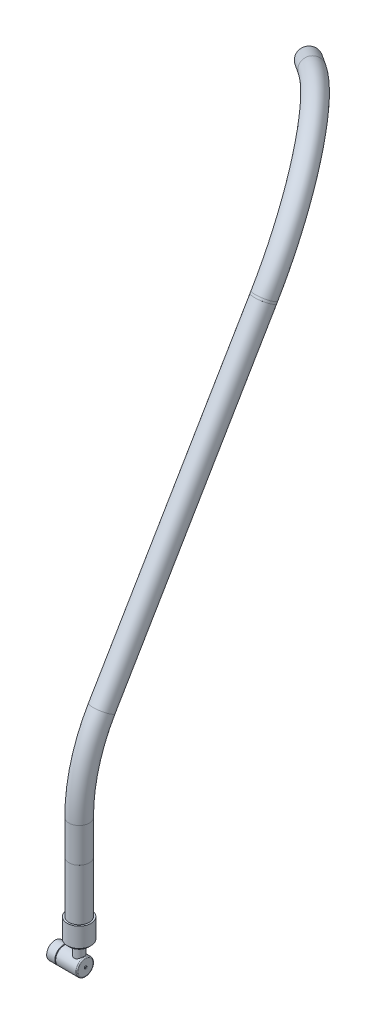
ISO-10303-21;
HEADER;
FILE_DESCRIPTION(('STEP AP214'),'2;1');
FILE_NAME('part.step','',(''),(''),'','','');
FILE_SCHEMA(('AUTOMOTIVE_DESIGN { 1 0 10303 214 1 1 1 1 }'));
ENDSEC;
DATA;
#1=APPLICATION_CONTEXT('core data for automotive mechanical design processes');
#2=APPLICATION_PROTOCOL_DEFINITION('international standard','automotive_design',2000,#1);
#3=PRODUCT_CONTEXT('',#1,'mechanical');
#4=PRODUCT('Part','Part','',(#3));
#5=PRODUCT_RELATED_PRODUCT_CATEGORY('part','',(#4));
#6=PRODUCT_DEFINITION_FORMATION('','',#4);
#7=PRODUCT_DEFINITION_CONTEXT('part definition',#1,'design');
#8=PRODUCT_DEFINITION('design','',#6,#7);
#9=PRODUCT_DEFINITION_SHAPE('','',#8);
#10=(LENGTH_UNIT() NAMED_UNIT(*) SI_UNIT(.MILLI.,.METRE.));
#11=(NAMED_UNIT(*) PLANE_ANGLE_UNIT() SI_UNIT($,.RADIAN.));
#12=(NAMED_UNIT(*) SI_UNIT($,.STERADIAN.) SOLID_ANGLE_UNIT());
#13=UNCERTAINTY_MEASURE_WITH_UNIT(LENGTH_MEASURE(1.E-05),#10,'distance_accuracy_value','');
#14=(GEOMETRIC_REPRESENTATION_CONTEXT(3) GLOBAL_UNCERTAINTY_ASSIGNED_CONTEXT((#13)) GLOBAL_UNIT_ASSIGNED_CONTEXT((#10,
#11,#12)) REPRESENTATION_CONTEXT('',''));
#15=CARTESIAN_POINT('',(0.,0.,0.));
#16=DIRECTION('',(0.,0.,1.));
#17=DIRECTION('',(1.,0.,0.));
#18=AXIS2_PLACEMENT_3D('',#15,#16,#17);
#19=CARTESIAN_POINT('',(-231.402057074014,1296.7226905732,-781.534195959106));
#20=DIRECTION('',(-0.669130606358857,0.377342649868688,0.640216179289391));
#21=DIRECTION('',(0.691323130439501,0.,0.722545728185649));
#22=AXIS2_PLACEMENT_3D('',#19,#20,#21);
#23=TOROIDAL_SURFACE('',#22,406.4,29.9720000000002);
#24=CARTESIAN_POINT('',(70.612,1434.80149921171,-547.26360041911));
#25=DIRECTION('',(0.,0.861495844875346,-0.507764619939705));
#26=DIRECTION('',(0.,0.507764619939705,0.861495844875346));
#27=AXIS2_PLACEMENT_3D('',#24,#25,#26);
#28=CIRCLE('',#27,29.9720000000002);
#29=CARTESIAN_POINT('',(92.8855367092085,1444.9848113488,-529.986143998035));
#30=VERTEX_POINT('',#29);
#31=EDGE_CURVE('E394',#30,#30,#28,.T.);
#32=CARTESIAN_POINT('',(-221.411113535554,1651.21076854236,-980.026874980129));
#33=DIRECTION('',(-0.74273808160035,-0.311075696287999,-0.592935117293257));
#34=DIRECTION('',(-0.48081103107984,0.864078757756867,0.148958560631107));
#35=AXIS2_PLACEMENT_3D('',#32,#33,#34);
#36=CIRCLE('',#35,29.9720000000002);
#37=CARTESIAN_POINT('',(-220.674281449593,1677.35426429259,-994.665710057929));
#38=VERTEX_POINT('',#37);
#39=EDGE_CURVE('E11',#38,#38,#36,.T.);
#40=CARTESIAN_POINT('',(-231.402057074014,1296.7226905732,-781.534195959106));
#41=DIRECTION('',(-0.669130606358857,0.377342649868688,0.640216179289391));
#42=DIRECTION('',(0.691323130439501,0.,0.722545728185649));
#43=AXIS2_PLACEMENT_3D('',#40,#41,#42);
#44=CIRCLE('',#43,436.372);
#45=EDGE_CURVE('',#30,#38,#44,.T.);
#46=ORIENTED_EDGE('',*,*,#31,.T.);
#47=ORIENTED_EDGE('',*,*,#39,.F.);
#48=ORIENTED_EDGE('',*,*,#45,.T.);
#49=ORIENTED_EDGE('',*,*,#45,.F.);
#50=EDGE_LOOP('',(#46,#48,#47,#49));
#51=FACE_BOUND('',#50,.T.);
#52=ADVANCED_FACE('F388',(#51),#23,.T.);
#53=CARTESIAN_POINT('',(70.612,1434.80149921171,-547.26360041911));
#54=DIRECTION('',(0.,-0.861495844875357,0.507764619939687));
#55=DIRECTION('',(0.,-0.507764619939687,-0.861495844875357));
#56=AXIS2_PLACEMENT_3D('',#53,#54,#55);
#57=CYLINDRICAL_SURFACE('',#56,29.9720000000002);
#58=ORIENTED_EDGE('',*,*,#31,.F.);
#59=EDGE_LOOP('',(#58));
#60=FACE_BOUND('',#59,.T.);
#61=CARTESIAN_POINT('',(70.6119999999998,1429.33100059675,-544.039295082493));
#62=DIRECTION('',(0.,0.861495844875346,-0.507764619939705));
#63=DIRECTION('',(0.,0.507764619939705,0.861495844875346));
#64=AXIS2_PLACEMENT_3D('',#61,#62,#63);
#65=CIRCLE('',#64,29.9720000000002);
#66=CARTESIAN_POINT('',(70.6119999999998,1444.54972178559,-518.218541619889));
#67=VERTEX_POINT('',#66);
#68=EDGE_CURVE('E398',#67,#67,#65,.T.);
#69=ORIENTED_EDGE('',*,*,#68,.T.);
#70=EDGE_LOOP('',(#69));
#71=FACE_BOUND('',#70,.T.);
#72=ADVANCED_FACE('F419',(#60,#71),#57,.T.);
#73=CARTESIAN_POINT('',(70.6119999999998,1429.33100059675,-544.039295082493));
#74=DIRECTION('',(0.,0.861495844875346,-0.507764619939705));
#75=DIRECTION('',(0.,0.507764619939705,0.861495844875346));
#76=AXIS2_PLACEMENT_3D('',#73,#74,#75);
#77=PLANE('',#76);
#78=ORIENTED_EDGE('',*,*,#68,.F.);
#79=EDGE_LOOP('',(#78));
#80=FACE_BOUND('',#79,.T.);
#81=ADVANCED_FACE('F412',(#80),#77,.F.);
#82=CARTESIAN_POINT('',(-273.291368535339,1629.48213115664,-1021.44339292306));
#83=DIRECTION('',(0.74273808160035,0.311075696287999,0.592935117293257));
#84=DIRECTION('',(0.623889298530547,0.,-0.781512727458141));
#85=AXIS2_PLACEMENT_3D('',#82,#83,#84);
#86=CYLINDRICAL_SURFACE('',#85,29.9720000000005);
#87=CARTESIAN_POINT('',(-273.291368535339,1629.48213115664,-1021.44339292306));
#88=DIRECTION('',(-0.74273808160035,-0.311075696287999,-0.592935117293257));
#89=DIRECTION('',(-0.623889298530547,0.,0.781512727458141));
#90=AXIS2_PLACEMENT_3D('',#87,#88,#89);
#91=CIRCLE('',#90,29.9720000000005);
#92=CARTESIAN_POINT('',(-291.990578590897,1629.48213115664,-998.019893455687));
#93=VERTEX_POINT('',#92);
#94=EDGE_CURVE('E402',#93,#93,#91,.T.);
#95=ORIENTED_EDGE('',*,*,#94,.F.);
#96=EDGE_LOOP('',(#95));
#97=FACE_BOUND('',#96,.T.);
#98=ORIENTED_EDGE('',*,*,#39,.T.);
#99=EDGE_LOOP('',(#98));
#100=FACE_BOUND('',#99,.T.);
#101=ADVANCED_FACE('F410',(#97,#100),#86,.T.);
#102=CARTESIAN_POINT('',(-273.291368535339,1629.48213115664,-1021.44339292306));
#103=DIRECTION('',(-0.74273808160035,-0.311075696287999,-0.592935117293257));
#104=DIRECTION('',(-0.623889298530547,0.,0.781512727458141));
#105=AXIS2_PLACEMENT_3D('',#102,#103,#104);
#106=PLANE('',#105);
#107=ORIENTED_EDGE('',*,*,#94,.T.);
#108=EDGE_LOOP('',(#107));
#109=FACE_BOUND('',#108,.T.);
#110=ADVANCED_FACE('F408',(#109),#106,.T.);
#111=CLOSED_SHELL('',(#52,#72,#81,#101,#110));
#112=MANIFOLD_SOLID_BREP('B2',#111);
#113=CARTESIAN_POINT('',(70.6119999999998,1429.33100059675,-544.039295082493));
#114=DIRECTION('',(0.,-0.861495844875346,0.507764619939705));
#115=DIRECTION('',(0.,-0.507764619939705,-0.861495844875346));
#116=AXIS2_PLACEMENT_3D('',#113,#114,#115);
#117=CYLINDRICAL_SURFACE('',#116,29.972);
#118=CARTESIAN_POINT('',(70.6119999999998,1429.33100059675,-544.039295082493));
#119=DIRECTION('',(0.,0.861495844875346,-0.507764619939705));
#120=DIRECTION('',(0.,0.507764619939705,0.861495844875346));
#121=AXIS2_PLACEMENT_3D('',#118,#119,#120);
#122=CIRCLE('',#121,29.972);
#123=CARTESIAN_POINT('',(70.6119999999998,1444.54972178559,-518.218541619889));
#124=VERTEX_POINT('',#123);
#125=EDGE_CURVE('E387',#124,#124,#122,.T.);
#126=ORIENTED_EDGE('',*,*,#125,.F.);
#127=EDGE_LOOP('',(#126));
#128=FACE_BOUND('',#127,.T.);
#129=CARTESIAN_POINT('',(70.6119999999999,619.697205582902,-66.842105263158));
#130=DIRECTION('',(0.,0.861495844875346,-0.507764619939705));
#131=DIRECTION('',(0.,0.507764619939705,0.861495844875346));
#132=AXIS2_PLACEMENT_3D('',#129,#130,#131);
#133=CIRCLE('',#132,29.972);
#134=CARTESIAN_POINT('',(70.6119999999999,634.915926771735,-41.0213518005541));
#135=VERTEX_POINT('',#134);
#136=EDGE_CURVE('E462',#135,#135,#133,.T.);
#137=ORIENTED_EDGE('',*,*,#136,.T.);
#138=EDGE_LOOP('',(#137));
#139=FACE_BOUND('',#138,.T.);
#140=ADVANCED_FACE('F456',(#128,#139),#117,.T.);
#141=CARTESIAN_POINT('',(70.6119999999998,1429.33100059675,-544.039295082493));
#142=DIRECTION('',(0.,0.861495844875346,-0.507764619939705));
#143=DIRECTION('',(0.,0.507764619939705,0.861495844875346));
#144=AXIS2_PLACEMENT_3D('',#141,#142,#143);
#145=PLANE('',#144);
#146=ORIENTED_EDGE('',*,*,#125,.T.);
#147=EDGE_LOOP('',(#146));
#148=FACE_BOUND('',#147,.T.);
#149=ADVANCED_FACE('F471',(#148),#145,.T.);
#150=CARTESIAN_POINT('',(70.6119999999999,619.697205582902,-66.842105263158));
#151=DIRECTION('',(0.,0.861495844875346,-0.507764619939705));
#152=DIRECTION('',(0.,0.507764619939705,0.861495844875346));
#153=AXIS2_PLACEMENT_3D('',#150,#151,#152);
#154=PLANE('',#153);
#155=ORIENTED_EDGE('',*,*,#136,.F.);
#156=EDGE_LOOP('',(#155));
#157=FACE_BOUND('',#156,.T.);
#158=ADVANCED_FACE('F469',(#157),#154,.F.);
#159=CLOSED_SHELL('',(#140,#149,#158));
#160=MANIFOLD_SOLID_BREP('B6',#159);
#161=CARTESIAN_POINT('',(70.6119999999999,374.65,-482.6));
#162=DIRECTION('',(-1.,0.,0.));
#163=DIRECTION('',(0.,0.,1.));
#164=AXIS2_PLACEMENT_3D('',#161,#162,#163);
#165=TOROIDAL_SURFACE('',#164,482.6,29.972);
#166=CARTESIAN_POINT('',(70.6119999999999,374.65,0.));
#167=DIRECTION('',(0.,1.,0.));
#168=DIRECTION('',(-1.,0.,0.));
#169=AXIS2_PLACEMENT_3D('',#166,#167,#168);
#170=CIRCLE('',#169,29.972);
#171=CARTESIAN_POINT('',(70.6119999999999,374.65,29.9719999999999));
#172=VERTEX_POINT('',#171);
#173=EDGE_CURVE('E504',#172,#172,#170,.T.);
#174=CARTESIAN_POINT('',(70.6119999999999,619.697205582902,-66.8421052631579));
#175=DIRECTION('',(0.,0.861495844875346,-0.507764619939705));
#176=DIRECTION('',(-1.,0.,0.));
#177=AXIS2_PLACEMENT_3D('',#174,#175,#176);
#178=CIRCLE('',#177,29.972);
#179=CARTESIAN_POINT('',(70.6119999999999,634.915926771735,-41.021351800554));
#180=VERTEX_POINT('',#179);
#181=EDGE_CURVE('E455',#180,#180,#178,.T.);
#182=CARTESIAN_POINT('',(70.6119999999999,374.65,-482.6));
#183=DIRECTION('',(-1.,0.,0.));
#184=DIRECTION('',(0.,0.,1.));
#185=AXIS2_PLACEMENT_3D('',#182,#183,#184);
#186=CIRCLE('',#185,512.572);
#187=EDGE_CURVE('',#172,#180,#186,.T.);
#188=ORIENTED_EDGE('',*,*,#173,.T.);
#189=ORIENTED_EDGE('',*,*,#181,.F.);
#190=ORIENTED_EDGE('',*,*,#187,.T.);
#191=ORIENTED_EDGE('',*,*,#187,.F.);
#192=EDGE_LOOP('',(#188,#190,#189,#191));
#193=FACE_BOUND('',#192,.T.);
#194=ADVANCED_FACE('F498',(#193),#165,.T.);
#195=CARTESIAN_POINT('',(70.6119999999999,374.65,0.));
#196=DIRECTION('',(0.,-1.,0.));
#197=DIRECTION('',(0.,0.,-1.));
#198=AXIS2_PLACEMENT_3D('',#195,#196,#197);
#199=CYLINDRICAL_SURFACE('',#198,29.972);
#200=ORIENTED_EDGE('',*,*,#173,.F.);
#201=EDGE_LOOP('',(#200));
#202=FACE_BOUND('',#201,.T.);
#203=CARTESIAN_POINT('',(70.6119999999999,273.05,0.));
#204=DIRECTION('',(0.,1.,0.));
#205=DIRECTION('',(-1.,0.,0.));
#206=AXIS2_PLACEMENT_3D('',#203,#204,#205);
#207=CIRCLE('',#206,29.972);
#208=CARTESIAN_POINT('',(40.6399999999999,273.05,0.));
#209=VERTEX_POINT('',#208);
#210=EDGE_CURVE('E508',#209,#209,#207,.T.);
#211=ORIENTED_EDGE('',*,*,#210,.T.);
#212=EDGE_LOOP('',(#211));
#213=FACE_BOUND('',#212,.T.);
#214=ADVANCED_FACE('F515',(#202,#213),#199,.T.);
#215=CARTESIAN_POINT('',(70.6119999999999,619.697205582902,-66.8421052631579));
#216=DIRECTION('',(0.,0.861495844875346,-0.507764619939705));
#217=DIRECTION('',(-1.,0.,0.));
#218=AXIS2_PLACEMENT_3D('',#215,#216,#217);
#219=PLANE('',#218);
#220=ORIENTED_EDGE('',*,*,#181,.T.);
#221=EDGE_LOOP('',(#220));
#222=FACE_BOUND('',#221,.T.);
#223=ADVANCED_FACE('F519',(#222),#219,.T.);
#224=CARTESIAN_POINT('',(70.6119999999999,273.05,0.));
#225=DIRECTION('',(0.,1.,0.));
#226=DIRECTION('',(-1.,0.,0.));
#227=AXIS2_PLACEMENT_3D('',#224,#225,#226);
#228=PLANE('',#227);
#229=ORIENTED_EDGE('',*,*,#210,.F.);
#230=EDGE_LOOP('',(#229));
#231=FACE_BOUND('',#230,.T.);
#232=ADVANCED_FACE('F517',(#231),#228,.F.);
#233=CLOSED_SHELL('',(#194,#214,#223,#232));
#234=MANIFOLD_SOLID_BREP('B382',#233);
#235=CARTESIAN_POINT('',(70.6119999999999,273.05,0.));
#236=DIRECTION('',(0.,-1.,0.));
#237=DIRECTION('',(1.,0.,0.));
#238=AXIS2_PLACEMENT_3D('',#235,#236,#237);
#239=CYLINDRICAL_SURFACE('',#238,29.972);
#240=CARTESIAN_POINT('',(70.6119999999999,273.05,0.));
#241=DIRECTION('',(0.,1.,0.));
#242=DIRECTION('',(-1.,0.,0.));
#243=AXIS2_PLACEMENT_3D('',#240,#241,#242);
#244=CIRCLE('',#243,29.972);
#245=CARTESIAN_POINT('',(100.584,273.05,0.));
#246=VERTEX_POINT('',#245);
#247=EDGE_CURVE('E497',#246,#246,#244,.T.);
#248=CARTESIAN_POINT('',(70.612,120.65,0.));
#249=DIRECTION('',(0.,1.,0.));
#250=DIRECTION('',(-1.,0.,0.));
#251=AXIS2_PLACEMENT_3D('',#248,#249,#250);
#252=CIRCLE('',#251,29.972);
#253=CARTESIAN_POINT('',(100.584,120.65,0.));
#254=VERTEX_POINT('',#253);
#255=EDGE_CURVE('E559',#254,#254,#252,.T.);
#256=CARTESIAN_POINT('',(100.584,273.05,0.));
#257=CARTESIAN_POINT('',(100.584,271.4625,0.));
#258=CARTESIAN_POINT('',(100.584,269.875,0.));
#259=CARTESIAN_POINT('',(100.584,266.7,0.));
#260=CARTESIAN_POINT('',(100.584,265.1125,0.));
#261=CARTESIAN_POINT('',(100.584,261.9375,0.));
#262=CARTESIAN_POINT('',(100.584,260.35,0.));
#263=CARTESIAN_POINT('',(100.584,257.175,0.));
#264=CARTESIAN_POINT('',(100.584,255.5875,0.));
#265=CARTESIAN_POINT('',(100.584,252.4125,0.));
#266=CARTESIAN_POINT('',(100.584,250.825,0.));
#267=CARTESIAN_POINT('',(100.584,247.65,0.));
#268=CARTESIAN_POINT('',(100.584,246.0625,0.));
#269=CARTESIAN_POINT('',(100.584,242.8875,0.));
#270=CARTESIAN_POINT('',(100.584,241.3,0.));
#271=CARTESIAN_POINT('',(100.584,238.125,0.));
#272=CARTESIAN_POINT('',(100.584,236.5375,0.));
#273=CARTESIAN_POINT('',(100.584,233.3625,0.));
#274=CARTESIAN_POINT('',(100.584,231.775,0.));
#275=CARTESIAN_POINT('',(100.584,228.6,0.));
#276=CARTESIAN_POINT('',(100.584,227.0125,0.));
#277=CARTESIAN_POINT('',(100.584,223.8375,0.));
#278=CARTESIAN_POINT('',(100.584,222.25,0.));
#279=CARTESIAN_POINT('',(100.584,219.075,0.));
#280=CARTESIAN_POINT('',(100.584,217.4875,0.));
#281=CARTESIAN_POINT('',(100.584,214.3125,0.));
#282=CARTESIAN_POINT('',(100.584,212.725,0.));
#283=CARTESIAN_POINT('',(100.584,209.55,0.));
#284=CARTESIAN_POINT('',(100.584,207.9625,0.));
#285=CARTESIAN_POINT('',(100.584,204.7875,0.));
#286=CARTESIAN_POINT('',(100.584,203.2,0.));
#287=CARTESIAN_POINT('',(100.584,200.025,0.));
#288=CARTESIAN_POINT('',(100.584,198.4375,0.));
#289=CARTESIAN_POINT('',(100.584,195.2625,0.));
#290=CARTESIAN_POINT('',(100.584,193.675,0.));
#291=CARTESIAN_POINT('',(100.584,190.5,0.));
#292=CARTESIAN_POINT('',(100.584,188.9125,0.));
#293=CARTESIAN_POINT('',(100.584,185.7375,0.));
#294=CARTESIAN_POINT('',(100.584,184.15,0.));
#295=CARTESIAN_POINT('',(100.584,180.975,0.));
#296=CARTESIAN_POINT('',(100.584,179.3875,0.));
#297=CARTESIAN_POINT('',(100.584,176.2125,0.));
#298=CARTESIAN_POINT('',(100.584,174.625,0.));
#299=CARTESIAN_POINT('',(100.584,171.45,0.));
#300=CARTESIAN_POINT('',(100.584,169.8625,0.));
#301=CARTESIAN_POINT('',(100.584,166.6875,0.));
#302=CARTESIAN_POINT('',(100.584,165.1,0.));
#303=CARTESIAN_POINT('',(100.584,161.925,0.));
#304=CARTESIAN_POINT('',(100.584,160.3375,0.));
#305=CARTESIAN_POINT('',(100.584,157.1625,0.));
#306=CARTESIAN_POINT('',(100.584,155.575,0.));
#307=CARTESIAN_POINT('',(100.584,152.4,0.));
#308=CARTESIAN_POINT('',(100.584,150.8125,0.));
#309=CARTESIAN_POINT('',(100.584,147.6375,0.));
#310=CARTESIAN_POINT('',(100.584,146.05,0.));
#311=CARTESIAN_POINT('',(100.584,142.875,0.));
#312=CARTESIAN_POINT('',(100.584,141.2875,0.));
#313=CARTESIAN_POINT('',(100.584,138.1125,0.));
#314=CARTESIAN_POINT('',(100.584,136.525,0.));
#315=CARTESIAN_POINT('',(100.584,133.35,0.));
#316=CARTESIAN_POINT('',(100.584,131.7625,0.));
#317=CARTESIAN_POINT('',(100.584,128.5875,0.));
#318=CARTESIAN_POINT('',(100.584,127.,0.));
#319=CARTESIAN_POINT('',(100.584,123.825,0.));
#320=CARTESIAN_POINT('',(100.584,122.2375,0.));
#321=CARTESIAN_POINT('',(100.584,120.65,0.));
#322=B_SPLINE_CURVE_WITH_KNOTS('',3,(#256,#257,#258,#259,#260,#261,#262,#263,#264,#265,#266,
#267,#268,#269,#270,#271,#272,#273,#274,#275,#276,#277,#278,#279,#280,#281,#282,#283,#284,#285,
#286,#287,#288,#289,#290,#291,#292,#293,#294,#295,#296,#297,#298,#299,#300,#301,#302,#303,#304,
#305,#306,#307,#308,#309,#310,#311,#312,#313,#314,#315,#316,#317,#318,#319,#320,#321),
.UNSPECIFIED.,.F.,.F.,(4,2,2,2,2,2,2,2,2,2,2,2,2,2,2,2,2,2,2,2,2,2,2,2,2,2,2,2,2,2,2,2,4),(0.,
4.76249999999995,9.52499999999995,14.2875,19.05,23.8125,28.575,33.3375,38.1,42.8625,47.625,
52.3875,57.15,61.9125,66.675,71.4375,76.2,80.9625,85.725,90.4875,95.25,100.0125,104.775,
109.5375,114.3,119.0625,123.825,128.5875,133.35,138.1125,142.875,147.6375,152.4),.UNSPECIFIED.);
#323=EDGE_CURVE('BSEAM553',#246,#254,#322,.T.);
#324=ORIENTED_EDGE('',*,*,#247,.F.);
#325=ORIENTED_EDGE('',*,*,#255,.T.);
#326=ORIENTED_EDGE('',*,*,#323,.T.);
#327=ORIENTED_EDGE('',*,*,#323,.F.);
#328=EDGE_LOOP('',(#324,#326,#325,#327));
#329=FACE_BOUND('',#328,.T.);
#330=ADVANCED_FACE('F553',(#329),#239,.T.);
#331=CARTESIAN_POINT('',(70.6119999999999,273.05,0.));
#332=DIRECTION('',(0.,1.,0.));
#333=DIRECTION('',(-1.,0.,0.));
#334=AXIS2_PLACEMENT_3D('',#331,#332,#333);
#335=PLANE('',#334);
#336=ORIENTED_EDGE('',*,*,#247,.T.);
#337=EDGE_LOOP('',(#336));
#338=FACE_BOUND('',#337,.T.);
#339=ADVANCED_FACE('F568',(#338),#335,.T.);
#340=CARTESIAN_POINT('',(70.612,120.65,0.));
#341=DIRECTION('',(0.,1.,0.));
#342=DIRECTION('',(-1.,0.,0.));
#343=AXIS2_PLACEMENT_3D('',#340,#341,#342);
#344=PLANE('',#343);
#345=ORIENTED_EDGE('',*,*,#255,.F.);
#346=EDGE_LOOP('',(#345));
#347=FACE_BOUND('',#346,.T.);
#348=ADVANCED_FACE('F566',(#347),#344,.F.);
#349=CLOSED_SHELL('',(#330,#339,#348));
#350=MANIFOLD_SOLID_BREP('B450',#349);
#351=CARTESIAN_POINT('',(91.694,0.,0.));
#352=DIRECTION('',(-1.,0.,0.));
#353=DIRECTION('',(0.,0.,1.));
#354=AXIS2_PLACEMENT_3D('',#351,#352,#353);
#355=CYLINDRICAL_SURFACE('',#354,3.6195);
#356=CARTESIAN_POINT('',(90.17,0.,0.));
#357=DIRECTION('',(1.,0.,0.));
#358=DIRECTION('',(0.,0.,-1.));
#359=AXIS2_PLACEMENT_3D('',#356,#357,#358);
#360=CIRCLE('',#359,3.6195);
#361=CARTESIAN_POINT('',(90.17,0.,-3.6195));
#362=VERTEX_POINT('',#361);
#363=EDGE_CURVE('E552',#362,#362,#360,.F.);
#364=ORIENTED_EDGE('',*,*,#363,.T.);
#365=EDGE_LOOP('',(#364));
#366=FACE_BOUND('',#365,.T.);
#367=CARTESIAN_POINT('',(89.408,0.,0.));
#368=DIRECTION('',(1.,0.,0.));
#369=DIRECTION('',(0.,0.,-1.));
#370=AXIS2_PLACEMENT_3D('',#367,#368,#369);
#371=CIRCLE('',#370,3.6195);
#372=CARTESIAN_POINT('',(89.408,0.,-3.6195));
#373=VERTEX_POINT('',#372);
#374=EDGE_CURVE('E605',#373,#373,#371,.T.);
#375=ORIENTED_EDGE('',*,*,#374,.T.);
#376=EDGE_LOOP('',(#375));
#377=FACE_BOUND('',#376,.T.);
#378=ADVANCED_FACE('F595',(#366,#377),#355,.T.);
#379=CARTESIAN_POINT('',(91.694,0.,0.));
#380=DIRECTION('',(1.,0.,0.));
#381=DIRECTION('',(0.,0.,-1.));
#382=AXIS2_PLACEMENT_3D('',#379,#380,#381);
#383=PLANE('',#382);
#384=CARTESIAN_POINT('',(91.694,0.,0.));
#385=DIRECTION('',(1.,0.,0.));
#386=DIRECTION('',(0.,0.,-1.));
#387=AXIS2_PLACEMENT_3D('',#384,#385,#386);
#388=CIRCLE('',#387,2.0955);
#389=CARTESIAN_POINT('',(91.694,0.,-2.0955));
#390=VERTEX_POINT('',#389);
#391=EDGE_CURVE('E601',#390,#390,#388,.T.);
#392=ORIENTED_EDGE('',*,*,#391,.T.);
#393=EDGE_LOOP('',(#392));
#394=FACE_BOUND('',#393,.T.);
#395=ADVANCED_FACE('F616',(#394),#383,.T.);
#396=CARTESIAN_POINT('',(89.408,0.,0.));
#397=DIRECTION('',(1.,0.,0.));
#398=DIRECTION('',(0.,0.,-1.));
#399=AXIS2_PLACEMENT_3D('',#396,#397,#398);
#400=PLANE('',#399);
#401=ORIENTED_EDGE('',*,*,#374,.F.);
#402=EDGE_LOOP('',(#401));
#403=FACE_BOUND('',#402,.T.);
#404=ADVANCED_FACE('F613',(#403),#400,.F.);
#405=CARTESIAN_POINT('',(90.17,0.,0.));
#406=DIRECTION('',(1.,0.,0.));
#407=DIRECTION('',(0.,0.,-1.));
#408=AXIS2_PLACEMENT_3D('',#405,#406,#407);
#409=TOROIDAL_SURFACE('',#408,2.0955,1.524);
#410=ORIENTED_EDGE('',*,*,#363,.F.);
#411=EDGE_LOOP('',(#410));
#412=FACE_BOUND('',#411,.T.);
#413=ORIENTED_EDGE('',*,*,#391,.F.);
#414=EDGE_LOOP('',(#413));
#415=FACE_BOUND('',#414,.T.);
#416=ADVANCED_FACE('F615',(#412,#415),#409,.T.);
#417=CLOSED_SHELL('',(#378,#395,#404,#416));
#418=MANIFOLD_SOLID_BREP('B492',#417);
#419=CARTESIAN_POINT('',(89.408,0.,0.));
#420=DIRECTION('',(-1.,0.,0.));
#421=DIRECTION('',(0.,0.,1.));
#422=AXIS2_PLACEMENT_3D('',#419,#420,#421);
#423=CYLINDRICAL_SURFACE('',#422,25.4);
#424=CARTESIAN_POINT('',(86.233,0.,0.));
#425=DIRECTION('',(1.,0.,0.));
#426=DIRECTION('',(0.,0.,-1.));
#427=AXIS2_PLACEMENT_3D('',#424,#425,#426);
#428=CIRCLE('',#427,25.4);
#429=CARTESIAN_POINT('',(86.233,0.,-25.4));
#430=VERTEX_POINT('',#429);
#431=EDGE_CURVE('E662',#430,#430,#428,.F.);
#432=ORIENTED_EDGE('',*,*,#431,.T.);
#433=EDGE_LOOP('',(#432));
#434=FACE_BOUND('',#433,.T.);
#435=CARTESIAN_POINT('',(26.67,0.,0.));
#436=DIRECTION('',(1.,0.,0.));
#437=DIRECTION('',(0.,0.,-1.));
#438=AXIS2_PLACEMENT_3D('',#435,#436,#437);
#439=CIRCLE('',#438,25.4);
#440=CARTESIAN_POINT('',(26.67,0.,-25.4));
#441=VERTEX_POINT('',#440);
#442=EDGE_CURVE('E677',#441,#441,#439,.T.);
#443=ORIENTED_EDGE('',*,*,#442,.T.);
#444=EDGE_LOOP('',(#443));
#445=FACE_BOUND('',#444,.T.);
#446=CARTESIAN_POINT('',(56.388,25.4,0.));
#447=CARTESIAN_POINT('',(56.387998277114,25.4000015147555,0.36870087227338));
#448=CARTESIAN_POINT('',(56.4023506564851,25.3919554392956,0.737380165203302));
#449=CARTESIAN_POINT('',(56.4595581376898,25.3599855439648,1.47180213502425));
#450=CARTESIAN_POINT('',(56.5024110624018,25.3360629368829,1.83754503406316));
#451=CARTESIAN_POINT('',(56.6160575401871,25.2729500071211,2.56334225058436));
#452=CARTESIAN_POINT('',(56.6868535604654,25.23375833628,2.92339606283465));
#453=CARTESIAN_POINT('',(56.8555056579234,25.1410819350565,3.63522175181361));
#454=CARTESIAN_POINT('',(56.9533625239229,25.0875967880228,3.98699338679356));
#455=CARTESIAN_POINT('',(57.1745985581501,24.9678386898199,4.6786503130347));
#456=CARTESIAN_POINT('',(57.2978799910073,24.9016147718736,5.01857546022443));
#457=CARTESIAN_POINT('',(57.5689372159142,24.7577487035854,5.68598521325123));
#458=CARTESIAN_POINT('',(57.7167127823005,24.6801066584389,6.01346993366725));
#459=CARTESIAN_POINT('',(58.0354451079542,24.515076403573,6.65436190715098));
#460=CARTESIAN_POINT('',(58.20640115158,24.4276884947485,6.96776959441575));
#461=CARTESIAN_POINT('',(58.570260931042,24.2449283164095,7.57927040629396));
#462=CARTESIAN_POINT('',(58.7631727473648,24.1495531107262,7.87735783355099));
#463=CARTESIAN_POINT('',(59.1839017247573,23.9458354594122,8.47727627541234));
#464=CARTESIAN_POINT('',(59.4132173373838,23.8370526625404,8.77790704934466));
#465=CARTESIAN_POINT('',(59.8941000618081,23.6149470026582,9.3590091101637));
#466=CARTESIAN_POINT('',(60.1456680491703,23.5016239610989,9.63947960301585));
#467=CARTESIAN_POINT('',(60.6700740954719,23.272816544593,10.1794940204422));
#468=CARTESIAN_POINT('',(60.9429359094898,23.1573298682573,10.439013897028));
#469=CARTESIAN_POINT('',(61.5084182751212,22.9269790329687,10.9356550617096));
#470=CARTESIAN_POINT('',(61.8010331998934,22.8121147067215,11.172782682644));
#471=CARTESIAN_POINT('',(62.4363375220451,22.5739627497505,11.6470476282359));
#472=CARTESIAN_POINT('',(62.7810728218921,22.4510370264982,11.8816353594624));
#473=CARTESIAN_POINT('',(63.4918775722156,22.2131004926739,12.3207368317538));
#474=CARTESIAN_POINT('',(63.8579498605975,22.0980907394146,12.5252465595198));
#475=CARTESIAN_POINT('',(64.6091914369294,21.8801850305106,12.9021257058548));
#476=CARTESIAN_POINT('',(64.9943375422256,21.7772748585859,13.0745329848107));
#477=CARTESIAN_POINT('',(65.7818526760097,21.5875498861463,13.3854740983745));
#478=CARTESIAN_POINT('',(66.1842163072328,21.5007300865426,13.5240184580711));
#479=CARTESIAN_POINT('',(66.9158558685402,21.3634994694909,13.7394876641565));
#480=CARTESIAN_POINT('',(67.2424157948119,21.3092726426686,13.8232525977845));
#481=CARTESIAN_POINT('',(67.9026044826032,21.2149003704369,13.9676579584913));
#482=CARTESIAN_POINT('',(68.2362322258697,21.1747529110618,14.0283016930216));
#483=CARTESIAN_POINT('',(68.9081659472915,21.1099304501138,14.1256598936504));
#484=CARTESIAN_POINT('',(69.2464676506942,21.0852421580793,14.1623949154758));
#485=CARTESIAN_POINT('',(69.9256466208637,21.0521703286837,14.2115098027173));
#486=CARTESIAN_POINT('',(70.2665239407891,21.0437871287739,14.2238891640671));
#487=CARTESIAN_POINT('',(70.9486844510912,21.0436382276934,14.2241094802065));
#488=CARTESIAN_POINT('',(71.2899676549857,21.0518917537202,14.2119220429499));
#489=CARTESIAN_POINT('',(71.9699814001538,21.0847477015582,14.1631306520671));
#490=CARTESIAN_POINT('',(72.3087119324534,21.1093501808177,14.1265266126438));
#491=CARTESIAN_POINT('',(72.9814001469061,21.1740338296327,14.0293863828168));
#492=CARTESIAN_POINT('',(73.315355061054,21.2141236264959,13.9688368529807));
#493=CARTESIAN_POINT('',(73.976175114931,21.3084141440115,13.8245757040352));
#494=CARTESIAN_POINT('',(74.3030400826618,21.3626152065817,13.7408635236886));
#495=CARTESIAN_POINT('',(74.947503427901,21.4833495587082,13.5513204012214));
#496=CARTESIAN_POINT('',(75.2651121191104,21.5498684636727,13.4455152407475));
#497=CARTESIAN_POINT('',(75.8901060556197,21.693401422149,13.212684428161));
#498=CARTESIAN_POINT('',(76.1974878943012,21.7704189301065,13.0856517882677));
#499=CARTESIAN_POINT('',(76.80077912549,21.9329523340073,12.811362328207));
#500=CARTESIAN_POINT('',(77.0966874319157,22.0184690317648,12.6641035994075));
#501=CARTESIAN_POINT('',(77.6760541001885,22.1960047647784,12.3502983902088));
#502=CARTESIAN_POINT('',(77.95951177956,22.2880241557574,12.1837508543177));
#503=CARTESIAN_POINT('',(78.5559557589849,22.4911970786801,11.8050442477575));
#504=CARTESIAN_POINT('',(78.8667372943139,22.603110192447,11.5898137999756));
#505=CARTESIAN_POINT('',(79.4694036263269,22.8301008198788,11.1360159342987));
#506=CARTESIAN_POINT('',(79.7612920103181,22.9451777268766,10.8974529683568));
#507=CARTESIAN_POINT('',(80.3253868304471,23.1758798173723,10.3978059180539));
#508=CARTESIAN_POINT('',(80.597575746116,23.291505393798,10.1367022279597));
#509=CARTESIAN_POINT('',(81.1208067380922,23.5205764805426,9.59319869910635));
#510=CARTESIAN_POINT('',(81.3718479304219,23.6340218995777,9.31079797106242));
#511=CARTESIAN_POINT('',(81.8766785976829,23.8678787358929,8.69504849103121));
#512=CARTESIAN_POINT('',(82.1279905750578,23.9877714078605,8.35946338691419));
#513=CARTESIAN_POINT('',(82.6012863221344,24.2185491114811,7.6652257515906));
#514=CARTESIAN_POINT('',(82.8232676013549,24.3294333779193,7.30657126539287));
#515=CARTESIAN_POINT('',(83.2356789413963,24.5390213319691,6.56837501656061));
#516=CARTESIAN_POINT('',(83.4261242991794,24.6377309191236,6.18884350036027));
#517=CARTESIAN_POINT('',(83.77338462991,24.820113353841,5.41122718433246));
#518=CARTESIAN_POINT('',(83.9302037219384,24.903788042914,5.01314466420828));
#519=CARTESIAN_POINT('',(84.1983037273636,25.0482264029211,4.2300741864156));
#520=CARTESIAN_POINT('',(84.3120144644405,25.1101888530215,3.84613945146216));
#521=CARTESIAN_POINT('',(84.5070270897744,25.2171160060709,3.06778748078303));
#522=CARTESIAN_POINT('',(84.5883302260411,25.2620813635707,2.67337064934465));
#523=CARTESIAN_POINT('',(84.7172692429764,25.3336449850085,1.87772541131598));
#524=CARTESIAN_POINT('',(84.7649306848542,25.3602571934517,1.4765024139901));
#525=CARTESIAN_POINT('',(84.8259231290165,25.3943454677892,0.670660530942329));
#526=CARTESIAN_POINT('',(84.8392576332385,25.4018234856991,0.266041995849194));
#527=CARTESIAN_POINT('',(84.8318518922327,25.3976777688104,-0.495906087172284));
#528=CARTESIAN_POINT('',(84.8148753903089,25.3881638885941,-0.853290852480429));
#529=CARTESIAN_POINT('',(84.7541486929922,25.35424131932,-1.56503785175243));
#530=CARTESIAN_POINT('',(84.7104009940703,25.329834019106,-1.91940036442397));
#531=CARTESIAN_POINT('',(84.5966741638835,25.2667113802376,-2.62258088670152));
#532=CARTESIAN_POINT('',(84.5266949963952,25.2279960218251,-2.97139888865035));
#533=CARTESIAN_POINT('',(84.3613202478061,25.1371609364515,-3.66116958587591));
#534=CARTESIAN_POINT('',(84.265923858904,25.0850407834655,-4.00212203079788));
#535=CARTESIAN_POINT('',(84.0513340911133,24.9688893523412,-4.67221260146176));
#536=CARTESIAN_POINT('',(83.9322751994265,24.9049255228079,-5.00140562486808));
#537=CARTESIAN_POINT('',(83.6711690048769,24.7662569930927,-5.64817781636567));
#538=CARTESIAN_POINT('',(83.529122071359,24.6915524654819,-5.96575717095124));
#539=CARTESIAN_POINT('',(83.2232055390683,24.5329008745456,-6.58785559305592));
#540=CARTESIAN_POINT('',(83.0593332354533,24.4489526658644,-6.89237303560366));
#541=CARTESIAN_POINT('',(82.7109475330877,24.2734363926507,-7.48708468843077));
#542=CARTESIAN_POINT('',(82.5264317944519,24.1818674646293,-7.77727726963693));
#543=CARTESIAN_POINT('',(82.1177948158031,23.9830367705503,-8.37149811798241));
#544=CARTESIAN_POINT('',(81.8915510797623,23.8751314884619,-8.67385283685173));
#545=CARTESIAN_POINT('',(81.4167311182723,23.6545099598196,-9.2586088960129));
#546=CARTESIAN_POINT('',(81.1681535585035,23.5417934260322,-9.54100904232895));
#547=CARTESIAN_POINT('',(80.6496805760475,23.3139138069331,-10.0850628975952));
#548=CARTESIAN_POINT('',(80.3797629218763,23.198748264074,-10.3466943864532));
#549=CARTESIAN_POINT('',(79.8200223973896,22.9686831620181,-10.8478397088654));
#550=CARTESIAN_POINT('',(79.5301992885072,22.8537836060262,-11.0873532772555));
#551=CARTESIAN_POINT('',(78.9006285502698,22.6151661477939,-11.5669025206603));
#552=CARTESIAN_POINT('',(78.5588226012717,22.4917725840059,-11.8044061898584));
#553=CARTESIAN_POINT('',(77.8537579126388,22.2524368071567,-12.2496106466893));
#554=CARTESIAN_POINT('',(77.490496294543,22.1364955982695,-12.457307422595));
#555=CARTESIAN_POINT('',(76.7446931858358,21.9162267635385,-12.8408674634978));
#556=CARTESIAN_POINT('',(76.362174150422,21.8118860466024,-13.016766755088));
#557=CARTESIAN_POINT('',(75.5796738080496,21.6187892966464,-13.3350157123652));
#558=CARTESIAN_POINT('',(75.1796978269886,21.5300285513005,-13.4773755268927));
#559=CARTESIAN_POINT('',(74.4506880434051,21.3886341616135,-13.7003609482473));
#560=CARTESIAN_POINT('',(74.1243983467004,21.3323282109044,-13.7876727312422));
#561=CARTESIAN_POINT('',(73.4644277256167,21.2336477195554,-13.9391679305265));
#562=CARTESIAN_POINT('',(73.1307478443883,21.1912712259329,-14.0033545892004));
#563=CARTESIAN_POINT('',(72.4583677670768,21.1219126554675,-14.1077547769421));
#564=CARTESIAN_POINT('',(72.1196722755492,21.0949169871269,-14.1479894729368));
#565=CARTESIAN_POINT('',(71.4393439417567,21.0572311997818,-14.2040193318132));
#566=CARTESIAN_POINT('',(71.0977110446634,21.0465413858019,-14.2198140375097));
#567=CARTESIAN_POINT('',(70.4135857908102,21.0418636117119,-14.2267352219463));
#568=CARTESIAN_POINT('',(70.0710929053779,21.0478997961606,-14.2178260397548));
#569=CARTESIAN_POINT('',(69.3883384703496,21.0764992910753,-14.1753950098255));
#570=CARTESIAN_POINT('',(69.048076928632,21.0990626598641,-14.1418730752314));
#571=CARTESIAN_POINT('',(68.3720616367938,21.1599086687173,-14.0506674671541));
#572=CARTESIAN_POINT('',(68.0363104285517,21.198199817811,-13.9929707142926));
#573=CARTESIAN_POINT('',(67.3716887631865,21.2891766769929,-13.8541626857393));
#574=CARTESIAN_POINT('',(67.0428184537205,21.3418626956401,-13.7730509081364));
#575=CARTESIAN_POINT('',(66.3961305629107,21.4595194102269,-13.5889974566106));
#576=CARTESIAN_POINT('',(66.0782510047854,21.5244000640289,-13.4862151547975));
#577=CARTESIAN_POINT('',(65.4524886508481,21.6648415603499,-13.2594276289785));
#578=CARTESIAN_POINT('',(65.1446091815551,21.740405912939,-13.135415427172));
#579=CARTESIAN_POINT('',(64.5401214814,21.900240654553,-12.8671607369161));
#580=CARTESIAN_POINT('',(64.2435142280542,21.9845117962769,-12.7229164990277));
#581=CARTESIAN_POINT('',(63.6625615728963,22.1597788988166,-12.4151343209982));
#582=CARTESIAN_POINT('',(63.3782168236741,22.2507752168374,-12.2515953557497));
#583=CARTESIAN_POINT('',(62.7803505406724,22.451763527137,-11.8797932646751));
#584=CARTESIAN_POINT('',(62.4689666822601,22.5625400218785,-11.6685107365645));
#585=CARTESIAN_POINT('',(61.8647716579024,22.7875673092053,-11.2227051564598));
#586=CARTESIAN_POINT('',(61.5719570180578,22.9018174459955,-10.9881864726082));
#587=CARTESIAN_POINT('',(61.0056663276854,23.1311995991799,-10.496723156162));
#588=CARTESIAN_POINT('',(60.7322074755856,23.2463323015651,-10.239759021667));
#589=CARTESIAN_POINT('',(60.20606332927,23.4747775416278,-9.70461098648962));
#590=CARTESIAN_POINT('',(59.9533789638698,23.5880899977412,-9.42642613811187));
#591=CARTESIAN_POINT('',(59.4434814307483,23.822613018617,-8.81819999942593));
#592=CARTESIAN_POINT('',(59.1888192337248,23.9433240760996,-8.48581901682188));
#593=CARTESIAN_POINT('',(58.7085334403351,24.1761498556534,-7.79779939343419));
#594=CARTESIAN_POINT('',(58.4829123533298,24.2882638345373,-7.44215874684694));
#595=CARTESIAN_POINT('',(58.0629017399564,24.500711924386,-6.70972609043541));
#596=CARTESIAN_POINT('',(57.8684985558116,24.6010511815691,-6.33294342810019));
#597=CARTESIAN_POINT('',(57.5130054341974,24.7870637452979,-5.56050451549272));
#598=CARTESIAN_POINT('',(57.35191167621,24.8727387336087,-5.16485043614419));
#599=CARTESIAN_POINT('',(57.0744460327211,25.0217986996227,-4.38375358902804));
#600=CARTESIAN_POINT('',(56.9558550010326,25.0862671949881,-3.99930638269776));
#601=CARTESIAN_POINT('',(56.7512591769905,25.198226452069,-3.21939839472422));
#602=CARTESIAN_POINT('',(56.665253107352,25.2457178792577,-2.8239380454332));
#603=CARTESIAN_POINT('',(56.5271576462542,25.3222689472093,-2.02567105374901));
#604=CARTESIAN_POINT('',(56.4750431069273,25.3513422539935,-1.62287008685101));
#605=CARTESIAN_POINT('',(56.4054667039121,25.390206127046,-0.813370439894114));
#606=CARTESIAN_POINT('',(56.3880019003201,25.3999983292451,-0.406672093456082));
#607=CARTESIAN_POINT('',(56.388,25.4,0.));
#608=B_SPLINE_CURVE_WITH_KNOTS('',3,(#446,#447,#448,#449,#450,#451,#452,#453,#454,#455,#456,
#457,#458,#459,#460,#461,#462,#463,#464,#465,#466,#467,#468,#469,#470,#471,#472,#473,#474,#475,
#476,#477,#478,#479,#480,#481,#482,#483,#484,#485,#486,#487,#488,#489,#490,#491,#492,#493,#494,
#495,#496,#497,#498,#499,#500,#501,#502,#503,#504,#505,#506,#507,#508,#509,#510,#511,#512,#513,
#514,#515,#516,#517,#518,#519,#520,#521,#522,#523,#524,#525,#526,#527,#528,#529,#530,#531,#532,
#533,#534,#535,#536,#537,#538,#539,#540,#541,#542,#543,#544,#545,#546,#547,#548,#549,#550,#551,
#552,#553,#554,#555,#556,#557,#558,#559,#560,#561,#562,#563,#564,#565,#566,#567,#568,#569,#570,
#571,#572,#573,#574,#575,#576,#577,#578,#579,#580,#581,#582,#583,#584,#585,#586,#587,#588,#589,
#590,#591,#592,#593,#594,#595,#596,#597,#598,#599,#600,#601,#602,#603,#604,#605,#606,#607),
.UNSPECIFIED.,.T.,.F.,(4,2,2,2,2,2,2,2,2,2,2,2,2,2,2,2,2,2,2,2,2,2,2,2,2,2,2,2,2,2,2,2,2,2,2,2,
2,2,2,2,2,2,2,2,2,2,2,2,2,2,2,2,2,2,2,2,2,2,2,2,2,2,2,2,2,2,2,2,2,2,2,2,2,2,2,2,2,2,2,2,4),(0.,
1.10570123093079,2.21131800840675,3.31703242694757,4.42277908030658,5.52435178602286,
6.62591434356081,7.72744290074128,8.82937817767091,10.0084971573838,11.1876625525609,
12.3681627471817,13.5483280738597,14.850891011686,16.1536275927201,17.4548179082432,
18.7556032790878,19.7789401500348,20.8021305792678,21.8244401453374,22.8467708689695,
23.8702837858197,24.893800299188,25.9178877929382,26.9420001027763,27.9649239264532,
28.9881851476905,30.0115429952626,31.0349568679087,32.2165010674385,33.3978202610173,
34.5801775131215,35.7625841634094,37.0691041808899,38.3757350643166,39.681730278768,
40.9875654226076,42.2014053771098,43.4151985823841,44.628068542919,45.8408147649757,
46.9132541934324,47.9855936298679,49.0579345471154,50.1303095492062,51.1967555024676,
52.2631843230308,53.3297454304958,54.3964275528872,55.5734403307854,56.7505234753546,
57.9288494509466,59.1071895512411,60.4079748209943,61.7089350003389,63.0084118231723,
64.3074949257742,65.3337301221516,66.3598213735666,67.3850044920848,68.4102067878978,
69.436889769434,70.4635763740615,71.4908191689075,72.5180839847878,73.5380422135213,
74.5583363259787,75.5787187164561,76.5991553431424,77.7747525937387,78.9501292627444,
80.1265375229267,81.3029983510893,82.6086775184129,83.9144694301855,85.2196884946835,
86.5247577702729,87.7453893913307,88.9659731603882,90.185650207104,91.4052237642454),.UNSPECIFIED.);
#609=CARTESIAN_POINT('',(56.388,25.4,0.));
#610=VERTEX_POINT('',#609);
#611=EDGE_CURVE('E671',#610,#610,#608,.T.);
#612=ORIENTED_EDGE('',*,*,#611,.F.);
#613=EDGE_LOOP('',(#612));
#614=FACE_BOUND('',#613,.T.);
#615=ADVANCED_FACE('F650',(#434,#445,#614),#423,.T.);
#616=CARTESIAN_POINT('',(89.408,0.,0.));
#617=DIRECTION('',(1.,0.,0.));
#618=DIRECTION('',(0.,0.,-1.));
#619=AXIS2_PLACEMENT_3D('',#616,#617,#618);
#620=PLANE('',#619);
#621=CARTESIAN_POINT('',(89.408,0.,0.));
#622=DIRECTION('',(1.,0.,0.));
#623=DIRECTION('',(0.,0.,-1.));
#624=AXIS2_PLACEMENT_3D('',#621,#622,#623);
#625=CIRCLE('',#624,22.225);
#626=CARTESIAN_POINT('',(89.408,0.,-22.225));
#627=VERTEX_POINT('',#626);
#628=EDGE_CURVE('E666',#627,#627,#625,.T.);
#629=ORIENTED_EDGE('',*,*,#628,.T.);
#630=EDGE_LOOP('',(#629));
#631=FACE_BOUND('',#630,.T.);
#632=ADVANCED_FACE('F689',(#631),#620,.T.);
#633=CARTESIAN_POINT('',(26.67,0.,0.));
#634=DIRECTION('',(1.,0.,0.));
#635=DIRECTION('',(0.,0.,-1.));
#636=AXIS2_PLACEMENT_3D('',#633,#634,#635);
#637=PLANE('',#636);
#638=ORIENTED_EDGE('',*,*,#442,.F.);
#639=EDGE_LOOP('',(#638));
#640=FACE_BOUND('',#639,.T.);
#641=ADVANCED_FACE('F685',(#640),#637,.F.);
#642=CARTESIAN_POINT('',(70.612,194.691,0.));
#643=DIRECTION('',(0.,1.,0.));
#644=DIRECTION('',(-1.,0.,0.));
#645=AXIS2_PLACEMENT_3D('',#642,#643,#644);
#646=CYLINDRICAL_SURFACE('',#645,14.224);
#647=CARTESIAN_POINT('',(70.612,50.8,0.));
#648=DIRECTION('',(0.,1.,0.));
#649=DIRECTION('',(-1.,0.,0.));
#650=AXIS2_PLACEMENT_3D('',#647,#648,#649);
#651=CIRCLE('',#650,14.224);
#652=CARTESIAN_POINT('',(56.388,50.8,0.));
#653=VERTEX_POINT('',#652);
#654=EDGE_CURVE('E716',#653,#653,#651,.T.);
#655=ORIENTED_EDGE('',*,*,#654,.F.);
#656=EDGE_LOOP('',(#655));
#657=FACE_BOUND('',#656,.T.);
#658=ORIENTED_EDGE('',*,*,#611,.T.);
#659=EDGE_LOOP('',(#658));
#660=FACE_BOUND('',#659,.T.);
#661=ADVANCED_FACE('F679',(#657,#660),#646,.T.);
#662=CARTESIAN_POINT('',(86.233,0.,0.));
#663=DIRECTION('',(1.,0.,0.));
#664=DIRECTION('',(0.,0.,-1.));
#665=AXIS2_PLACEMENT_3D('',#662,#663,#664);
#666=TOROIDAL_SURFACE('',#665,22.225,3.175);
#667=ORIENTED_EDGE('',*,*,#431,.F.);
#668=EDGE_LOOP('',(#667));
#669=FACE_BOUND('',#668,.T.);
#670=ORIENTED_EDGE('',*,*,#628,.F.);
#671=EDGE_LOOP('',(#670));
#672=FACE_BOUND('',#671,.T.);
#673=ADVANCED_FACE('F684',(#669,#672),#666,.T.);
#674=CARTESIAN_POINT('',(70.612,50.8,0.));
#675=DIRECTION('',(0.,1.,0.));
#676=DIRECTION('',(-1.,0.,0.));
#677=AXIS2_PLACEMENT_3D('',#674,#675,#676);
#678=CONICAL_SURFACE('',#677,14.224,0.78539816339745);
#679=CARTESIAN_POINT('',(70.612,57.15,0.));
#680=DIRECTION('',(0.,1.,0.));
#681=DIRECTION('',(-1.,0.,0.));
#682=AXIS2_PLACEMENT_3D('',#679,#680,#681);
#683=CIRCLE('',#682,20.574);
#684=CARTESIAN_POINT('',(50.038,57.15,0.));
#685=VERTEX_POINT('',#684);
#686=EDGE_CURVE('E727',#685,#685,#683,.T.);
#687=ORIENTED_EDGE('',*,*,#686,.F.);
#688=EDGE_LOOP('',(#687));
#689=FACE_BOUND('',#688,.T.);
#690=ORIENTED_EDGE('',*,*,#654,.T.);
#691=EDGE_LOOP('',(#690));
#692=FACE_BOUND('',#691,.T.);
#693=ADVANCED_FACE('F700',(#689,#692),#678,.T.);
#694=CARTESIAN_POINT('',(70.612,57.15,0.));
#695=DIRECTION('',(0.,1.,0.));
#696=DIRECTION('',(-1.,0.,0.));
#697=AXIS2_PLACEMENT_3D('',#694,#695,#696);
#698=PLANE('',#697);
#699=CARTESIAN_POINT('',(70.612,57.15,0.));
#700=DIRECTION('',(0.,1.,0.));
#701=DIRECTION('',(-1.,0.,0.));
#702=AXIS2_PLACEMENT_3D('',#699,#700,#701);
#703=CIRCLE('',#702,28.575);
#704=CARTESIAN_POINT('',(42.037,57.15,0.));
#705=VERTEX_POINT('',#704);
#706=EDGE_CURVE('E594',#705,#705,#703,.F.);
#707=ORIENTED_EDGE('',*,*,#706,.T.);
#708=EDGE_LOOP('',(#707));
#709=FACE_BOUND('',#708,.T.);
#710=ORIENTED_EDGE('',*,*,#686,.T.);
#711=EDGE_LOOP('',(#710));
#712=FACE_BOUND('',#711,.T.);
#713=ADVANCED_FACE('F706',(#709,#712),#698,.F.);
#714=CARTESIAN_POINT('',(70.612,120.65,0.));
#715=DIRECTION('',(0.,-1.,0.));
#716=DIRECTION('',(1.,0.,0.));
#717=AXIS2_PLACEMENT_3D('',#714,#715,#716);
#718=CYLINDRICAL_SURFACE('',#717,34.925);
#719=CARTESIAN_POINT('',(70.612,63.5,0.));
#720=DIRECTION('',(0.,1.,0.));
#721=DIRECTION('',(0.,0.,1.));
#722=AXIS2_PLACEMENT_3D('',#719,#720,#721);
#723=CIRCLE('',#722,34.925);
#724=CARTESIAN_POINT('',(70.612,63.5,34.925));
#725=VERTEX_POINT('',#724);
#726=EDGE_CURVE('E658',#725,#725,#723,.T.);
#727=ORIENTED_EDGE('',*,*,#726,.T.);
#728=EDGE_LOOP('',(#727));
#729=FACE_BOUND('',#728,.T.);
#730=CARTESIAN_POINT('',(70.612,120.65,0.));
#731=DIRECTION('',(0.,1.,0.));
#732=DIRECTION('',(-1.,0.,0.));
#733=AXIS2_PLACEMENT_3D('',#730,#731,#732);
#734=CIRCLE('',#733,34.925);
#735=CARTESIAN_POINT('',(35.687,120.65,0.));
#736=VERTEX_POINT('',#735);
#737=EDGE_CURVE('E730',#736,#736,#734,.T.);
#738=ORIENTED_EDGE('',*,*,#737,.F.);
#739=EDGE_LOOP('',(#738));
#740=FACE_BOUND('',#739,.T.);
#741=ADVANCED_FACE('F736',(#729,#740),#718,.T.);
#742=CARTESIAN_POINT('',(70.612,120.65,0.));
#743=DIRECTION('',(0.,1.,0.));
#744=DIRECTION('',(-1.,0.,0.));
#745=AXIS2_PLACEMENT_3D('',#742,#743,#744);
#746=PLANE('',#745);
#747=ORIENTED_EDGE('',*,*,#737,.T.);
#748=EDGE_LOOP('',(#747));
#749=FACE_BOUND('',#748,.T.);
#750=ADVANCED_FACE('F734',(#749),#746,.T.);
#751=CARTESIAN_POINT('',(70.612,63.5,0.));
#752=DIRECTION('',(0.,1.,0.));
#753=DIRECTION('',(0.,0.,1.));
#754=AXIS2_PLACEMENT_3D('',#751,#752,#753);
#755=CONICAL_SURFACE('',#754,34.925,0.78539816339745);
#756=ORIENTED_EDGE('',*,*,#706,.F.);
#757=EDGE_LOOP('',(#756));
#758=FACE_BOUND('',#757,.T.);
#759=ORIENTED_EDGE('',*,*,#726,.F.);
#760=EDGE_LOOP('',(#759));
#761=FACE_BOUND('',#760,.T.);
#762=ADVANCED_FACE('F744',(#758,#761),#755,.T.);
#763=CLOSED_SHELL('',(#615,#632,#641,#661,#673,#693,#713,#741,#750,#762));
#764=CARTESIAN_POINT('',(70.612,28.448,0.));
#765=DIRECTION('',(0.,1.,0.));
#766=DIRECTION('',(-1.,0.,0.));
#767=AXIS2_PLACEMENT_3D('',#764,#765,#766);
#768=PLANE('',#767);
#769=CARTESIAN_POINT('',(70.612,28.448,0.));
#770=DIRECTION('',(0.,1.,0.));
#771=DIRECTION('',(-1.,0.,0.));
#772=AXIS2_PLACEMENT_3D('',#769,#770,#771);
#773=CIRCLE('',#772,11.938);
#774=CARTESIAN_POINT('',(58.674,28.448,0.));
#775=VERTEX_POINT('',#774);
#776=EDGE_CURVE('E718',#775,#775,#773,.T.);
#777=ORIENTED_EDGE('',*,*,#776,.T.);
#778=EDGE_LOOP('',(#777));
#779=FACE_BOUND('',#778,.T.);
#780=ADVANCED_FACE('F754',(#779),#768,.T.);
#781=CARTESIAN_POINT('',(70.612,28.448,0.));
#782=DIRECTION('',(0.,1.,0.));
#783=DIRECTION('',(-1.,0.,0.));
#784=AXIS2_PLACEMENT_3D('',#781,#782,#783);
#785=CYLINDRICAL_SURFACE('',#784,11.938);
#786=ORIENTED_EDGE('',*,*,#776,.F.);
#787=EDGE_LOOP('',(#786));
#788=FACE_BOUND('',#787,.T.);
#789=CARTESIAN_POINT('',(70.612,50.8,0.));
#790=DIRECTION('',(0.,1.,0.));
#791=DIRECTION('',(-1.,0.,0.));
#792=AXIS2_PLACEMENT_3D('',#789,#790,#791);
#793=CIRCLE('',#792,11.938);
#794=CARTESIAN_POINT('',(58.674,50.8,0.));
#795=VERTEX_POINT('',#794);
#796=EDGE_CURVE('E722',#795,#795,#793,.F.);
#797=ORIENTED_EDGE('',*,*,#796,.F.);
#798=EDGE_LOOP('',(#797));
#799=FACE_BOUND('',#798,.T.);
#800=ADVANCED_FACE('F750',(#788,#799),#785,.F.);
#801=CARTESIAN_POINT('',(70.612,50.8,0.));
#802=DIRECTION('',(0.,1.,0.));
#803=DIRECTION('',(-1.,0.,0.));
#804=AXIS2_PLACEMENT_3D('',#801,#802,#803);
#805=PLANE('',#804);
#806=ORIENTED_EDGE('',*,*,#796,.T.);
#807=EDGE_LOOP('',(#806));
#808=FACE_BOUND('',#807,.T.);
#809=ADVANCED_FACE('F748',(#808),#805,.F.);
#810=CLOSED_SHELL('',(#780,#800,#809));
#811=ORIENTED_CLOSED_SHELL('',*,#810,.T.);
#812=BREP_WITH_VOIDS('B547',#763,(#811));
#813=CARTESIAN_POINT('',(25.908,0.,0.));
#814=DIRECTION('',(1.,0.,0.));
#815=DIRECTION('',(0.,0.,-1.));
#816=AXIS2_PLACEMENT_3D('',#813,#814,#815);
#817=PLANE('',#816);
#818=CARTESIAN_POINT('',(25.908,0.,0.));
#819=DIRECTION('',(1.,0.,0.));
#820=DIRECTION('',(0.,0.,-1.));
#821=AXIS2_PLACEMENT_3D('',#818,#819,#820);
#822=CIRCLE('',#821,23.876);
#823=CARTESIAN_POINT('',(25.908,0.,-23.876));
#824=VERTEX_POINT('',#823);
#825=EDGE_CURVE('E821',#824,#824,#822,.T.);
#826=ORIENTED_EDGE('',*,*,#825,.T.);
#827=EDGE_LOOP('',(#826));
#828=FACE_BOUND('',#827,.T.);
#829=CARTESIAN_POINT('',(25.908,0.,0.));
#830=DIRECTION('',(1.,0.,0.));
#831=DIRECTION('',(0.,0.,-1.));
#832=AXIS2_PLACEMENT_3D('',#829,#830,#831);
#833=CIRCLE('',#832,22.225);
#834=CARTESIAN_POINT('',(25.908,0.,22.225));
#835=VERTEX_POINT('',#834);
#836=EDGE_CURVE('E834',#835,#835,#833,.T.);
#837=ORIENTED_EDGE('',*,*,#836,.F.);
#838=EDGE_LOOP('',(#837));
#839=FACE_BOUND('',#838,.T.);
#840=ADVANCED_FACE('F814',(#828,#839),#817,.T.);
#841=CARTESIAN_POINT('',(25.908,0.,0.));
#842=DIRECTION('',(-1.,0.,0.));
#843=DIRECTION('',(0.,0.,1.));
#844=AXIS2_PLACEMENT_3D('',#841,#842,#843);
#845=CYLINDRICAL_SURFACE('',#844,25.4);
#846=CARTESIAN_POINT('',(24.384,0.,0.));
#847=DIRECTION('',(1.,0.,0.));
#848=DIRECTION('',(0.,0.,-1.));
#849=AXIS2_PLACEMENT_3D('',#846,#847,#848);
#850=CIRCLE('',#849,25.4);
#851=CARTESIAN_POINT('',(24.384,0.,-25.4));
#852=VERTEX_POINT('',#851);
#853=EDGE_CURVE('E648',#852,#852,#850,.F.);
#854=ORIENTED_EDGE('',*,*,#853,.T.);
#855=EDGE_LOOP('',(#854));
#856=FACE_BOUND('',#855,.T.);
#857=CARTESIAN_POINT('',(0.,0.,0.));
#858=DIRECTION('',(1.,0.,0.));
#859=DIRECTION('',(0.,0.,-1.));
#860=AXIS2_PLACEMENT_3D('',#857,#858,#859);
#861=CIRCLE('',#860,25.4);
#862=CARTESIAN_POINT('',(0.,0.,-25.4));
#863=VERTEX_POINT('',#862);
#864=EDGE_CURVE('E825',#863,#863,#861,.T.);
#865=ORIENTED_EDGE('',*,*,#864,.T.);
#866=EDGE_LOOP('',(#865));
#867=FACE_BOUND('',#866,.T.);
#868=ADVANCED_FACE('F816',(#856,#867),#845,.T.);
#869=CARTESIAN_POINT('',(0.,0.,0.));
#870=DIRECTION('',(1.,0.,0.));
#871=DIRECTION('',(0.,0.,-1.));
#872=AXIS2_PLACEMENT_3D('',#869,#870,#871);
#873=PLANE('',#872);
#874=CARTESIAN_POINT('',(0.,0.,0.));
#875=DIRECTION('',(1.,0.,0.));
#876=DIRECTION('',(0.,0.,-1.));
#877=AXIS2_PLACEMENT_3D('',#874,#875,#876);
#878=CIRCLE('',#877,23.876);
#879=CARTESIAN_POINT('',(0.,0.,-23.876));
#880=VERTEX_POINT('',#879);
#881=EDGE_CURVE('E838',#880,#880,#878,.T.);
#882=ORIENTED_EDGE('',*,*,#881,.T.);
#883=EDGE_LOOP('',(#882));
#884=FACE_BOUND('',#883,.T.);
#885=ORIENTED_EDGE('',*,*,#864,.F.);
#886=EDGE_LOOP('',(#885));
#887=FACE_BOUND('',#886,.T.);
#888=ADVANCED_FACE('F877',(#884,#887),#873,.F.);
#889=CARTESIAN_POINT('',(26.67,0.,0.));
#890=DIRECTION('',(-1.,0.,0.));
#891=DIRECTION('',(0.,0.,1.));
#892=AXIS2_PLACEMENT_3D('',#889,#890,#891);
#893=CYLINDRICAL_SURFACE('',#892,22.225);
#894=CARTESIAN_POINT('',(26.67,0.,0.));
#895=DIRECTION('',(1.,0.,0.));
#896=DIRECTION('',(0.,0.,-1.));
#897=AXIS2_PLACEMENT_3D('',#894,#895,#896);
#898=CIRCLE('',#897,22.225);
#899=CARTESIAN_POINT('',(26.67,0.,22.225));
#900=VERTEX_POINT('',#899);
#901=EDGE_CURVE('E829',#900,#900,#898,.T.);
#902=CARTESIAN_POINT('',(26.67,0.,22.225));
#903=CARTESIAN_POINT('',(26.6620625,0.,22.225));
#904=CARTESIAN_POINT('',(26.654125,0.,22.225));
#905=CARTESIAN_POINT('',(26.63825,0.,22.225));
#906=CARTESIAN_POINT('',(26.6303125,0.,22.225));
#907=CARTESIAN_POINT('',(26.6144375,0.,22.225));
#908=CARTESIAN_POINT('',(26.6065,0.,22.225));
#909=CARTESIAN_POINT('',(26.590625,0.,22.225));
#910=CARTESIAN_POINT('',(26.5826875,0.,22.225));
#911=CARTESIAN_POINT('',(26.5668125,0.,22.225));
#912=CARTESIAN_POINT('',(26.558875,0.,22.225));
#913=CARTESIAN_POINT('',(26.543,0.,22.225));
#914=CARTESIAN_POINT('',(26.5350625,0.,22.225));
#915=CARTESIAN_POINT('',(26.5191875,0.,22.225));
#916=CARTESIAN_POINT('',(26.51125,0.,22.225));
#917=CARTESIAN_POINT('',(26.495375,0.,22.225));
#918=CARTESIAN_POINT('',(26.4874375,0.,22.225));
#919=CARTESIAN_POINT('',(26.4715625,0.,22.225));
#920=CARTESIAN_POINT('',(26.463625,0.,22.225));
#921=CARTESIAN_POINT('',(26.44775,0.,22.225));
#922=CARTESIAN_POINT('',(26.4398125,0.,22.225));
#923=CARTESIAN_POINT('',(26.4239375,0.,22.225));
#924=CARTESIAN_POINT('',(26.416,0.,22.225));
#925=CARTESIAN_POINT('',(26.400125,0.,22.225));
#926=CARTESIAN_POINT('',(26.3921875,0.,22.225));
#927=CARTESIAN_POINT('',(26.3763125,0.,22.225));
#928=CARTESIAN_POINT('',(26.368375,0.,22.225));
#929=CARTESIAN_POINT('',(26.3525,0.,22.225));
#930=CARTESIAN_POINT('',(26.3445625,0.,22.225));
#931=CARTESIAN_POINT('',(26.3286875,0.,22.225));
#932=CARTESIAN_POINT('',(26.32075,0.,22.225));
#933=CARTESIAN_POINT('',(26.304875,0.,22.225));
#934=CARTESIAN_POINT('',(26.2969375,0.,22.225));
#935=CARTESIAN_POINT('',(26.2810625,0.,22.225));
#936=CARTESIAN_POINT('',(26.273125,0.,22.225));
#937=CARTESIAN_POINT('',(26.25725,0.,22.225));
#938=CARTESIAN_POINT('',(26.2493125,0.,22.225));
#939=CARTESIAN_POINT('',(26.2334375,0.,22.225));
#940=CARTESIAN_POINT('',(26.2255,0.,22.225));
#941=CARTESIAN_POINT('',(26.209625,0.,22.225));
#942=CARTESIAN_POINT('',(26.2016875,0.,22.225));
#943=CARTESIAN_POINT('',(26.1858125,0.,22.225));
#944=CARTESIAN_POINT('',(26.177875,0.,22.225));
#945=CARTESIAN_POINT('',(26.162,0.,22.225));
#946=CARTESIAN_POINT('',(26.1540625,0.,22.225));
#947=CARTESIAN_POINT('',(26.1381875,0.,22.225));
#948=CARTESIAN_POINT('',(26.13025,0.,22.225));
#949=CARTESIAN_POINT('',(26.114375,0.,22.225));
#950=CARTESIAN_POINT('',(26.1064375,0.,22.225));
#951=CARTESIAN_POINT('',(26.0905625,0.,22.225));
#952=CARTESIAN_POINT('',(26.082625,0.,22.225));
#953=CARTESIAN_POINT('',(26.06675,0.,22.225));
#954=CARTESIAN_POINT('',(26.0588125,0.,22.225));
#955=CARTESIAN_POINT('',(26.0429375,0.,22.225));
#956=CARTESIAN_POINT('',(26.035,0.,22.225));
#957=CARTESIAN_POINT('',(26.019125,0.,22.225));
#958=CARTESIAN_POINT('',(26.0111875,0.,22.225));
#959=CARTESIAN_POINT('',(25.9953125,0.,22.225));
#960=CARTESIAN_POINT('',(25.987375,0.,22.225));
#961=CARTESIAN_POINT('',(25.9715,0.,22.225));
#962=CARTESIAN_POINT('',(25.9635625,0.,22.225));
#963=CARTESIAN_POINT('',(25.9476875,0.,22.225));
#964=CARTESIAN_POINT('',(25.93975,0.,22.225));
#965=CARTESIAN_POINT('',(25.923875,0.,22.225));
#966=CARTESIAN_POINT('',(25.9159375,0.,22.225));
#967=CARTESIAN_POINT('',(25.908,0.,22.225));
#968=B_SPLINE_CURVE_WITH_KNOTS('',3,(#902,#903,#904,#905,#906,#907,#908,#909,#910,#911,#912,
#913,#914,#915,#916,#917,#918,#919,#920,#921,#922,#923,#924,#925,#926,#927,#928,#929,#930,#931,
#932,#933,#934,#935,#936,#937,#938,#939,#940,#941,#942,#943,#944,#945,#946,#947,#948,#949,#950,
#951,#952,#953,#954,#955,#956,#957,#958,#959,#960,#961,#962,#963,#964,#965,#966,#967),
.UNSPECIFIED.,.F.,.F.,(4,2,2,2,2,2,2,2,2,2,2,2,2,2,2,2,2,2,2,2,2,2,2,2,2,2,2,2,2,2,2,2,4),(0.,
0.0238125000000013,0.0476250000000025,0.0714375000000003,0.0952500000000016,0.119062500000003,
0.142875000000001,0.166687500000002,0.190500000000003,0.214312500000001,0.238125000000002,
0.2619375,0.285750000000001,0.309562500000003,0.333375,0.357187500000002,0.381000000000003,
0.404812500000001,0.428625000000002,0.4524375,0.476250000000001,0.500062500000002,0.523875,
0.547687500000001,0.571500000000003,0.5953125,0.619125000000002,0.642937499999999,
0.666750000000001,0.690562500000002,0.714375,0.738187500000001,0.762000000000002),.UNSPECIFIED.);
#969=EDGE_CURVE('BSEAM882',#900,#835,#968,.T.);
#970=ORIENTED_EDGE('',*,*,#901,.F.);
#971=ORIENTED_EDGE('',*,*,#836,.T.);
#972=ORIENTED_EDGE('',*,*,#969,.T.);
#973=ORIENTED_EDGE('',*,*,#969,.F.);
#974=EDGE_LOOP('',(#970,#972,#971,#973));
#975=FACE_BOUND('',#974,.T.);
#976=ADVANCED_FACE('F882',(#975),#893,.T.);
#977=CARTESIAN_POINT('',(26.67,0.,0.));
#978=DIRECTION('',(1.,0.,0.));
#979=DIRECTION('',(0.,0.,-1.));
#980=AXIS2_PLACEMENT_3D('',#977,#978,#979);
#981=PLANE('',#980);
#982=ORIENTED_EDGE('',*,*,#901,.T.);
#983=EDGE_LOOP('',(#982));
#984=FACE_BOUND('',#983,.T.);
#985=ADVANCED_FACE('F856',(#984),#981,.T.);
#986=CARTESIAN_POINT('',(24.384,0.,0.));
#987=DIRECTION('',(1.,0.,0.));
#988=DIRECTION('',(0.,0.,-1.));
#989=AXIS2_PLACEMENT_3D('',#986,#987,#988);
#990=PLANE('',#989);
#991=CARTESIAN_POINT('',(24.384,0.,0.));
#992=DIRECTION('',(1.,0.,0.));
#993=DIRECTION('',(0.,0.,-1.));
#994=AXIS2_PLACEMENT_3D('',#991,#992,#993);
#995=CIRCLE('',#994,23.876);
#996=CARTESIAN_POINT('',(24.384,0.,-23.876));
#997=VERTEX_POINT('',#996);
#998=EDGE_CURVE('E837',#997,#997,#995,.T.);
#999=ORIENTED_EDGE('',*,*,#998,.F.);
#1000=EDGE_LOOP('',(#999));
#1001=FACE_BOUND('',#1000,.T.);
#1002=CARTESIAN_POINT('',(24.384,0.,0.));
#1003=DIRECTION('',(1.,0.,0.));
#1004=DIRECTION('',(0.,0.,-1.));
#1005=AXIS2_PLACEMENT_3D('',#1002,#1003,#1004);
#1006=CIRCLE('',#1005,20.701);
#1007=CARTESIAN_POINT('',(24.384,0.,20.701));
#1008=VERTEX_POINT('',#1007);
#1009=EDGE_CURVE('E844',#1008,#1008,#1006,.T.);
#1010=ORIENTED_EDGE('',*,*,#1009,.T.);
#1011=EDGE_LOOP('',(#1010));
#1012=FACE_BOUND('',#1011,.T.);
#1013=ADVANCED_FACE('F853',(#1001,#1012),#990,.F.);
#1014=CARTESIAN_POINT('',(25.908,0.,0.));
#1015=DIRECTION('',(-1.,0.,0.));
#1016=DIRECTION('',(0.,0.,1.));
#1017=AXIS2_PLACEMENT_3D('',#1014,#1015,#1016);
#1018=CYLINDRICAL_SURFACE('',#1017,23.876);
#1019=ORIENTED_EDGE('',*,*,#998,.T.);
#1020=EDGE_LOOP('',(#1019));
#1021=FACE_BOUND('',#1020,.T.);
#1022=ORIENTED_EDGE('',*,*,#881,.F.);
#1023=EDGE_LOOP('',(#1022));
#1024=FACE_BOUND('',#1023,.T.);
#1025=ADVANCED_FACE('F850',(#1021,#1024),#1018,.F.);
#1026=CARTESIAN_POINT('',(26.67,0.,0.));
#1027=DIRECTION('',(-1.,0.,0.));
#1028=DIRECTION('',(0.,0.,1.));
#1029=AXIS2_PLACEMENT_3D('',#1026,#1027,#1028);
#1030=CYLINDRICAL_SURFACE('',#1029,20.701);
#1031=CARTESIAN_POINT('',(25.146,0.,0.));
#1032=DIRECTION('',(1.,0.,0.));
#1033=DIRECTION('',(0.,0.,-1.));
#1034=AXIS2_PLACEMENT_3D('',#1031,#1032,#1033);
#1035=CIRCLE('',#1034,20.701);
#1036=CARTESIAN_POINT('',(25.146,0.,20.701));
#1037=VERTEX_POINT('',#1036);
#1038=EDGE_CURVE('E841',#1037,#1037,#1035,.T.);
#1039=CARTESIAN_POINT('',(25.146,0.,20.701));
#1040=CARTESIAN_POINT('',(25.1380625,0.,20.701));
#1041=CARTESIAN_POINT('',(25.130125,0.,20.701));
#1042=CARTESIAN_POINT('',(25.11425,0.,20.701));
#1043=CARTESIAN_POINT('',(25.1063125,0.,20.701));
#1044=CARTESIAN_POINT('',(25.0904375,0.,20.701));
#1045=CARTESIAN_POINT('',(25.0825,0.,20.701));
#1046=CARTESIAN_POINT('',(25.066625,0.,20.701));
#1047=CARTESIAN_POINT('',(25.0586875,0.,20.701));
#1048=CARTESIAN_POINT('',(25.0428125,0.,20.701));
#1049=CARTESIAN_POINT('',(25.034875,0.,20.701));
#1050=CARTESIAN_POINT('',(25.019,0.,20.701));
#1051=CARTESIAN_POINT('',(25.0110625,0.,20.701));
#1052=CARTESIAN_POINT('',(24.9951875,0.,20.701));
#1053=CARTESIAN_POINT('',(24.98725,0.,20.701));
#1054=CARTESIAN_POINT('',(24.971375,0.,20.701));
#1055=CARTESIAN_POINT('',(24.9634375,0.,20.701));
#1056=CARTESIAN_POINT('',(24.9475625,0.,20.701));
#1057=CARTESIAN_POINT('',(24.939625,0.,20.701));
#1058=CARTESIAN_POINT('',(24.92375,0.,20.701));
#1059=CARTESIAN_POINT('',(24.9158125,0.,20.701));
#1060=CARTESIAN_POINT('',(24.8999375,0.,20.701));
#1061=CARTESIAN_POINT('',(24.892,0.,20.701));
#1062=CARTESIAN_POINT('',(24.876125,0.,20.701));
#1063=CARTESIAN_POINT('',(24.8681875,0.,20.701));
#1064=CARTESIAN_POINT('',(24.8523125,0.,20.701));
#1065=CARTESIAN_POINT('',(24.844375,0.,20.701));
#1066=CARTESIAN_POINT('',(24.8285,0.,20.701));
#1067=CARTESIAN_POINT('',(24.8205625,0.,20.701));
#1068=CARTESIAN_POINT('',(24.8046875,0.,20.701));
#1069=CARTESIAN_POINT('',(24.79675,0.,20.701));
#1070=CARTESIAN_POINT('',(24.780875,0.,20.701));
#1071=CARTESIAN_POINT('',(24.7729375,0.,20.701));
#1072=CARTESIAN_POINT('',(24.7570625,0.,20.701));
#1073=CARTESIAN_POINT('',(24.749125,0.,20.701));
#1074=CARTESIAN_POINT('',(24.73325,0.,20.701));
#1075=CARTESIAN_POINT('',(24.7253125,0.,20.701));
#1076=CARTESIAN_POINT('',(24.7094375,0.,20.701));
#1077=CARTESIAN_POINT('',(24.7015,0.,20.701));
#1078=CARTESIAN_POINT('',(24.685625,0.,20.701));
#1079=CARTESIAN_POINT('',(24.6776875,0.,20.701));
#1080=CARTESIAN_POINT('',(24.6618125,0.,20.701));
#1081=CARTESIAN_POINT('',(24.653875,0.,20.701));
#1082=CARTESIAN_POINT('',(24.638,0.,20.701));
#1083=CARTESIAN_POINT('',(24.6300625,0.,20.701));
#1084=CARTESIAN_POINT('',(24.6141875,0.,20.701));
#1085=CARTESIAN_POINT('',(24.60625,0.,20.701));
#1086=CARTESIAN_POINT('',(24.590375,0.,20.701));
#1087=CARTESIAN_POINT('',(24.5824375,0.,20.701));
#1088=CARTESIAN_POINT('',(24.5665625,0.,20.701));
#1089=CARTESIAN_POINT('',(24.558625,0.,20.701));
#1090=CARTESIAN_POINT('',(24.54275,0.,20.701));
#1091=CARTESIAN_POINT('',(24.5348125,0.,20.701));
#1092=CARTESIAN_POINT('',(24.5189375,0.,20.701));
#1093=CARTESIAN_POINT('',(24.511,0.,20.701));
#1094=CARTESIAN_POINT('',(24.495125,0.,20.701));
#1095=CARTESIAN_POINT('',(24.4871875,0.,20.701));
#1096=CARTESIAN_POINT('',(24.4713125,0.,20.701));
#1097=CARTESIAN_POINT('',(24.463375,0.,20.701));
#1098=CARTESIAN_POINT('',(24.4475,0.,20.701));
#1099=CARTESIAN_POINT('',(24.4395625,0.,20.701));
#1100=CARTESIAN_POINT('',(24.4236875,0.,20.701));
#1101=CARTESIAN_POINT('',(24.41575,0.,20.701));
#1102=CARTESIAN_POINT('',(24.399875,0.,20.701));
#1103=CARTESIAN_POINT('',(24.3919375,0.,20.701));
#1104=CARTESIAN_POINT('',(24.384,0.,20.701));
#1105=B_SPLINE_CURVE_WITH_KNOTS('',3,(#1039,#1040,#1041,#1042,#1043,#1044,#1045,#1046,#1047,
#1048,#1049,#1050,#1051,#1052,#1053,#1054,#1055,#1056,#1057,#1058,#1059,#1060,#1061,#1062,#1063,
#1064,#1065,#1066,#1067,#1068,#1069,#1070,#1071,#1072,#1073,#1074,#1075,#1076,#1077,#1078,#1079,
#1080,#1081,#1082,#1083,#1084,#1085,#1086,#1087,#1088,#1089,#1090,#1091,#1092,#1093,#1094,#1095,
#1096,#1097,#1098,#1099,#1100,#1101,#1102,#1103,#1104),.UNSPECIFIED.,.F.,.F.,(4,2,2,2,2,2,2,2,2,
2,2,2,2,2,2,2,2,2,2,2,2,2,2,2,2,2,2,2,2,2,2,2,4),(0.,0.0238125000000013,0.0476250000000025,
0.0714375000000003,0.0952500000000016,0.119062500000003,0.142875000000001,0.166687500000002,
0.1905,0.214312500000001,0.238125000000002,0.2619375,0.285750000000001,0.309562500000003,
0.333375,0.357187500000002,0.380999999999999,0.404812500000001,0.428625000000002,0.4524375,
0.476250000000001,0.500062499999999,0.523875,0.547687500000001,0.571499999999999,0.5953125,
0.619125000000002,0.642937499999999,0.666750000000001,0.690562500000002,0.714375,
0.738187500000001,0.761999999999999),.UNSPECIFIED.);
#1106=EDGE_CURVE('BSEAM860',#1037,#1008,#1105,.T.);
#1107=ORIENTED_EDGE('',*,*,#1038,.T.);
#1108=ORIENTED_EDGE('',*,*,#1009,.F.);
#1109=ORIENTED_EDGE('',*,*,#1106,.T.);
#1110=ORIENTED_EDGE('',*,*,#1106,.F.);
#1111=EDGE_LOOP('',(#1107,#1109,#1108,#1110));
#1112=FACE_BOUND('',#1111,.T.);
#1113=ADVANCED_FACE('F860',(#1112),#1030,.F.);
#1114=CARTESIAN_POINT('',(25.146,0.,0.));
#1115=DIRECTION('',(1.,0.,0.));
#1116=DIRECTION('',(0.,0.,-1.));
#1117=AXIS2_PLACEMENT_3D('',#1114,#1115,#1116);
#1118=PLANE('',#1117);
#1119=ORIENTED_EDGE('',*,*,#1038,.F.);
#1120=EDGE_LOOP('',(#1119));
#1121=FACE_BOUND('',#1120,.T.);
#1122=ADVANCED_FACE('F862',(#1121),#1118,.F.);
#1123=CARTESIAN_POINT('',(25.908,0.,0.));
#1124=DIRECTION('',(-1.,0.,0.));
#1125=DIRECTION('',(0.,0.,1.));
#1126=AXIS2_PLACEMENT_3D('',#1123,#1124,#1125);
#1127=CONICAL_SURFACE('',#1126,23.876,0.785398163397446);
#1128=ORIENTED_EDGE('',*,*,#853,.F.);
#1129=EDGE_LOOP('',(#1128));
#1130=FACE_BOUND('',#1129,.T.);
#1131=ORIENTED_EDGE('',*,*,#825,.F.);
#1132=EDGE_LOOP('',(#1131));
#1133=FACE_BOUND('',#1132,.T.);
#1134=ADVANCED_FACE('F869',(#1130,#1133),#1127,.T.);
#1135=CLOSED_SHELL('',(#840,#868,#888,#976,#985,#1013,#1025,#1113,#1122,#1134));
#1136=MANIFOLD_SOLID_BREP('B589',#1135);
#1137=ADVANCED_BREP_SHAPE_REPRESENTATION('',(#18,#112,#160,#234,#350,#418,#812,#1136),#14);
#1138=SHAPE_DEFINITION_REPRESENTATION(#9,#1137);
ENDSEC;
END-ISO-10303-21;
